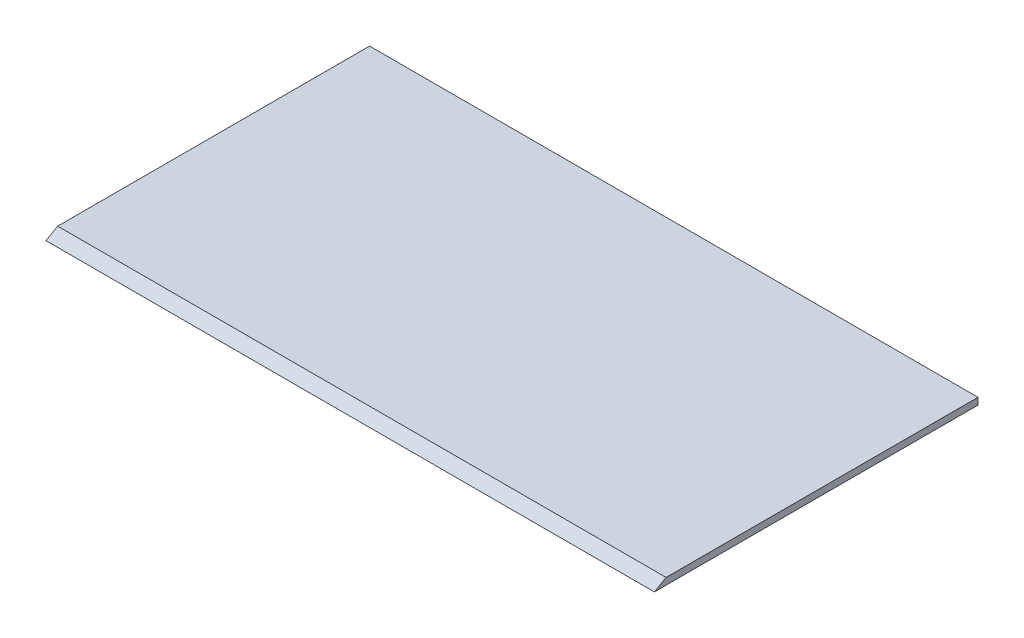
ISO-10303-21;
HEADER;
FILE_DESCRIPTION(('STEP AP214'),'2;1');
FILE_NAME('part.step','',(''),(''),'','','');
FILE_SCHEMA(('AUTOMOTIVE_DESIGN { 1 0 10303 214 1 1 1 1 }'));
ENDSEC;
DATA;
#1=APPLICATION_CONTEXT('core data for automotive mechanical design processes');
#2=APPLICATION_PROTOCOL_DEFINITION('international standard','automotive_design',2000,#1);
#3=PRODUCT_CONTEXT('',#1,'mechanical');
#4=PRODUCT('Part','Part','',(#3));
#5=PRODUCT_RELATED_PRODUCT_CATEGORY('part','',(#4));
#6=PRODUCT_DEFINITION_FORMATION('','',#4);
#7=PRODUCT_DEFINITION_CONTEXT('part definition',#1,'design');
#8=PRODUCT_DEFINITION('design','',#6,#7);
#9=PRODUCT_DEFINITION_SHAPE('','',#8);
#10=(LENGTH_UNIT() NAMED_UNIT(*) SI_UNIT(.MILLI.,.METRE.));
#11=(NAMED_UNIT(*) PLANE_ANGLE_UNIT() SI_UNIT($,.RADIAN.));
#12=(NAMED_UNIT(*) SI_UNIT($,.STERADIAN.) SOLID_ANGLE_UNIT());
#13=UNCERTAINTY_MEASURE_WITH_UNIT(LENGTH_MEASURE(1.E-05),#10,'distance_accuracy_value','');
#14=(GEOMETRIC_REPRESENTATION_CONTEXT(3) GLOBAL_UNCERTAINTY_ASSIGNED_CONTEXT((#13)) GLOBAL_UNIT_ASSIGNED_CONTEXT((#10,
#11,#12)) REPRESENTATION_CONTEXT('',''));
#15=CARTESIAN_POINT('',(0.,0.,0.));
#16=DIRECTION('',(0.,0.,1.));
#17=DIRECTION('',(1.,0.,0.));
#18=AXIS2_PLACEMENT_3D('',#15,#16,#17);
#19=CARTESIAN_POINT('',(573.0875,6.35,304.8));
#20=DIRECTION('',(-1.,0.,0.));
#21=DIRECTION('',(0.,0.,1.));
#22=AXIS2_PLACEMENT_3D('',#19,#20,#21);
#23=PLANE('',#22);
#24=DIRECTION('',(0.,0.,-1.));
#25=VECTOR('',#24,1.);
#26=CARTESIAN_POINT('',(573.0875,6.35,304.8));
#27=LINE('',#26,#25);
#28=CARTESIAN_POINT('',(573.0875,6.35000000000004,282.802954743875));
#29=VERTEX_POINT('',#28);
#30=CARTESIAN_POINT('',(573.0875,6.35,-304.8));
#31=VERTEX_POINT('',#30);
#32=EDGE_CURVE('E87',#29,#31,#27,.T.);
#33=ORIENTED_EDGE('',*,*,#32,.F.);
#34=DIRECTION('',(0.,0.499999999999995,-0.866025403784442));
#35=VECTOR('',#34,1.);
#36=CARTESIAN_POINT('',(573.0875,332.64179066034,-282.35100477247));
#37=LINE('',#36,#35);
#38=CARTESIAN_POINT('',(573.0875,-6.35,304.8));
#39=VERTEX_POINT('',#38);
#40=EDGE_CURVE('E76',#39,#29,#37,.T.);
#41=ORIENTED_EDGE('',*,*,#40,.F.);
#42=DIRECTION('',(0.,0.,-1.));
#43=VECTOR('',#42,1.);
#44=CARTESIAN_POINT('',(573.0875,-6.35,304.8));
#45=LINE('',#44,#43);
#46=CARTESIAN_POINT('',(573.0875,-6.35,-304.8));
#47=VERTEX_POINT('',#46);
#48=EDGE_CURVE('E86',#39,#47,#45,.T.);
#49=ORIENTED_EDGE('',*,*,#48,.T.);
#50=DIRECTION('',(0.,-1.,0.));
#51=VECTOR('',#50,1.);
#52=CARTESIAN_POINT('',(573.0875,6.35,-304.8));
#53=LINE('',#52,#51);
#54=EDGE_CURVE('E11',#31,#47,#53,.T.);
#55=ORIENTED_EDGE('',*,*,#54,.F.);
#56=EDGE_LOOP('',(#33,#41,#49,#55));
#57=FACE_BOUND('',#56,.T.);
#58=ADVANCED_FACE('F30',(#57),#23,.F.);
#59=CARTESIAN_POINT('',(-573.0875,6.35,-304.8));
#60=DIRECTION('',(0.,0.,1.));
#61=DIRECTION('',(1.,0.,0.));
#62=AXIS2_PLACEMENT_3D('',#59,#60,#61);
#63=PLANE('',#62);
#64=DIRECTION('',(-1.,0.,0.));
#65=VECTOR('',#64,1.);
#66=CARTESIAN_POINT('',(-573.0875,-6.35,-304.8));
#67=LINE('',#66,#65);
#68=CARTESIAN_POINT('',(-573.0875,-6.35,-304.8));
#69=VERTEX_POINT('',#68);
#70=EDGE_CURVE('E57',#47,#69,#67,.T.);
#71=ORIENTED_EDGE('',*,*,#70,.T.);
#72=DIRECTION('',(0.,-1.,0.));
#73=VECTOR('',#72,1.);
#74=CARTESIAN_POINT('',(-573.0875,6.35,-304.8));
#75=LINE('',#74,#73);
#76=CARTESIAN_POINT('',(-573.0875,6.35,-304.8));
#77=VERTEX_POINT('',#76);
#78=EDGE_CURVE('E38',#77,#69,#75,.T.);
#79=ORIENTED_EDGE('',*,*,#78,.F.);
#80=DIRECTION('',(-1.,0.,0.));
#81=VECTOR('',#80,1.);
#82=CARTESIAN_POINT('',(-573.0875,6.35,-304.8));
#83=LINE('',#82,#81);
#84=EDGE_CURVE('E46',#31,#77,#83,.T.);
#85=ORIENTED_EDGE('',*,*,#84,.F.);
#86=ORIENTED_EDGE('',*,*,#54,.T.);
#87=EDGE_LOOP('',(#71,#79,#85,#86));
#88=FACE_BOUND('',#87,.T.);
#89=ADVANCED_FACE('F104',(#88),#63,.F.);
#90=CARTESIAN_POINT('',(-573.0875,6.35,304.8));
#91=DIRECTION('',(1.,0.,0.));
#92=DIRECTION('',(0.,0.,-1.));
#93=AXIS2_PLACEMENT_3D('',#90,#91,#92);
#94=PLANE('',#93);
#95=DIRECTION('',(0.,0.,1.));
#96=VECTOR('',#95,1.);
#97=CARTESIAN_POINT('',(-573.0875,-6.35,304.8));
#98=LINE('',#97,#96);
#99=CARTESIAN_POINT('',(-573.0875,-6.35,304.8));
#100=VERTEX_POINT('',#99);
#101=EDGE_CURVE('E79',#69,#100,#98,.T.);
#102=ORIENTED_EDGE('',*,*,#101,.T.);
#103=DIRECTION('',(0.,0.499999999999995,-0.866025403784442));
#104=VECTOR('',#103,1.);
#105=CARTESIAN_POINT('',(-573.0875,332.64179066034,-282.35100477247));
#106=LINE('',#105,#104);
#107=CARTESIAN_POINT('',(-573.0875,6.35000000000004,282.802954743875));
#108=VERTEX_POINT('',#107);
#109=EDGE_CURVE('E64',#100,#108,#106,.T.);
#110=ORIENTED_EDGE('',*,*,#109,.T.);
#111=DIRECTION('',(0.,0.,1.));
#112=VECTOR('',#111,1.);
#113=CARTESIAN_POINT('',(-573.0875,6.35,304.8));
#114=LINE('',#113,#112);
#115=EDGE_CURVE('E91',#77,#108,#114,.T.);
#116=ORIENTED_EDGE('',*,*,#115,.F.);
#117=ORIENTED_EDGE('',*,*,#78,.T.);
#118=EDGE_LOOP('',(#102,#110,#116,#117));
#119=FACE_BOUND('',#118,.T.);
#120=ADVANCED_FACE('F80',(#119),#94,.F.);
#121=CARTESIAN_POINT('',(573.0875,6.35,-304.8));
#122=DIRECTION('',(0.,-1.,0.));
#123=DIRECTION('',(0.,0.,-1.));
#124=AXIS2_PLACEMENT_3D('',#121,#122,#123);
#125=PLANE('',#124);
#126=ORIENTED_EDGE('',*,*,#115,.T.);
#127=DIRECTION('',(1.,0.,0.));
#128=VECTOR('',#127,1.);
#129=CARTESIAN_POINT('',(-573.0875,6.35000000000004,282.802954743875));
#130=LINE('',#129,#128);
#131=EDGE_CURVE('E73',#108,#29,#130,.T.);
#132=ORIENTED_EDGE('',*,*,#131,.T.);
#133=ORIENTED_EDGE('',*,*,#32,.T.);
#134=ORIENTED_EDGE('',*,*,#84,.T.);
#135=EDGE_LOOP('',(#126,#132,#133,#134));
#136=FACE_BOUND('',#135,.T.);
#137=ADVANCED_FACE('F103',(#136),#125,.F.);
#138=CARTESIAN_POINT('',(573.0875,-6.35,-304.8));
#139=DIRECTION('',(0.,-1.,0.));
#140=DIRECTION('',(0.,0.,-1.));
#141=AXIS2_PLACEMENT_3D('',#138,#139,#140);
#142=PLANE('',#141);
#143=ORIENTED_EDGE('',*,*,#48,.F.);
#144=DIRECTION('',(1.,0.,0.));
#145=VECTOR('',#144,1.);
#146=CARTESIAN_POINT('',(-573.0875,-6.35,304.8));
#147=LINE('',#146,#145);
#148=EDGE_CURVE('E70',#100,#39,#147,.T.);
#149=ORIENTED_EDGE('',*,*,#148,.F.);
#150=ORIENTED_EDGE('',*,*,#101,.F.);
#151=ORIENTED_EDGE('',*,*,#70,.F.);
#152=EDGE_LOOP('',(#143,#149,#150,#151));
#153=FACE_BOUND('',#152,.T.);
#154=ADVANCED_FACE('F84',(#153),#142,.T.);
#155=CARTESIAN_POINT('',(-573.0875,332.64179066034,-282.35100477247));
#156=DIRECTION('',(0.,-0.866025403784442,-0.499999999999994));
#157=DIRECTION('',(0.,0.499999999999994,-0.866025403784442));
#158=AXIS2_PLACEMENT_3D('',#155,#156,#157);
#159=PLANE('',#158);
#160=ORIENTED_EDGE('',*,*,#40,.T.);
#161=ORIENTED_EDGE('',*,*,#131,.F.);
#162=ORIENTED_EDGE('',*,*,#109,.F.);
#163=ORIENTED_EDGE('',*,*,#148,.T.);
#164=EDGE_LOOP('',(#160,#161,#162,#163));
#165=FACE_BOUND('',#164,.T.);
#166=ADVANCED_FACE('F67',(#165),#159,.F.);
#167=CLOSED_SHELL('',(#58,#89,#120,#137,#154,#166));
#168=MANIFOLD_SOLID_BREP('B2',#167);
#169=ADVANCED_BREP_SHAPE_REPRESENTATION('',(#18,#168),#14);
#170=SHAPE_DEFINITION_REPRESENTATION(#9,#169);
ENDSEC;
END-ISO-10303-21;
